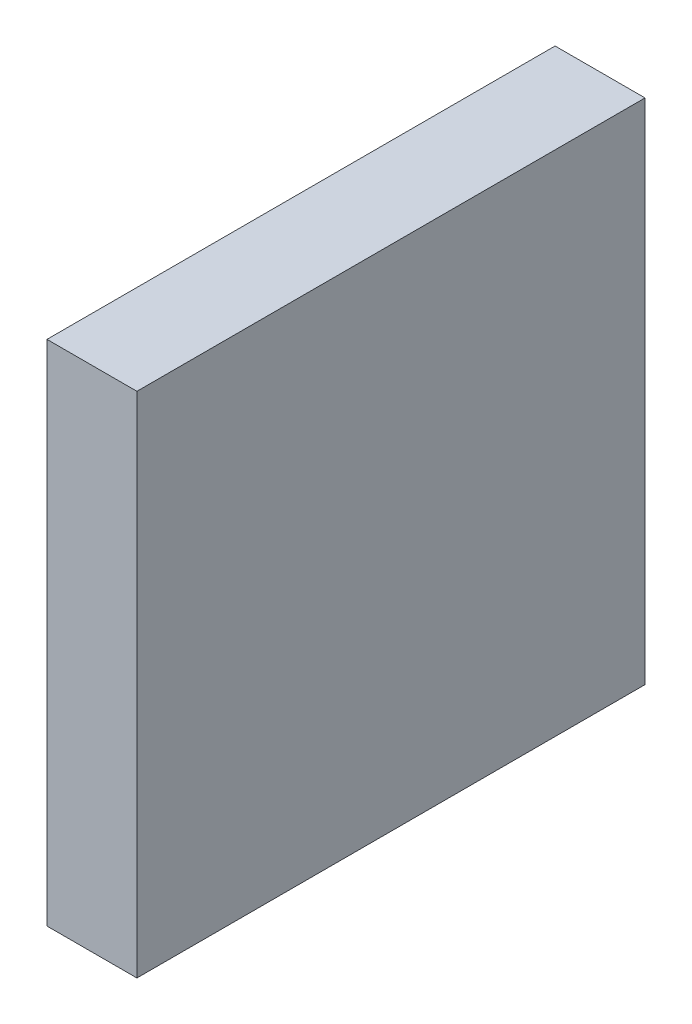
from build123d import *

# Parameters (mm, degrees)
FINALCUT_W      = 25.4
FINALCUT_H      = 25.4
THICKNESS_DEPTH = 4.4958


with BuildPart() as part:
    # FinalCut → Thickness (new body)
    with BuildSketch(Plane(origin=(0, 0, 0), x_dir=(0, 0, -1), z_dir=(1, 0, 0))):
        with Locations((12.7, 12.7)):
            Rectangle(FINALCUT_W, FINALCUT_H)
    extrude(amount=THICKNESS_DEPTH)


solid = part.part
